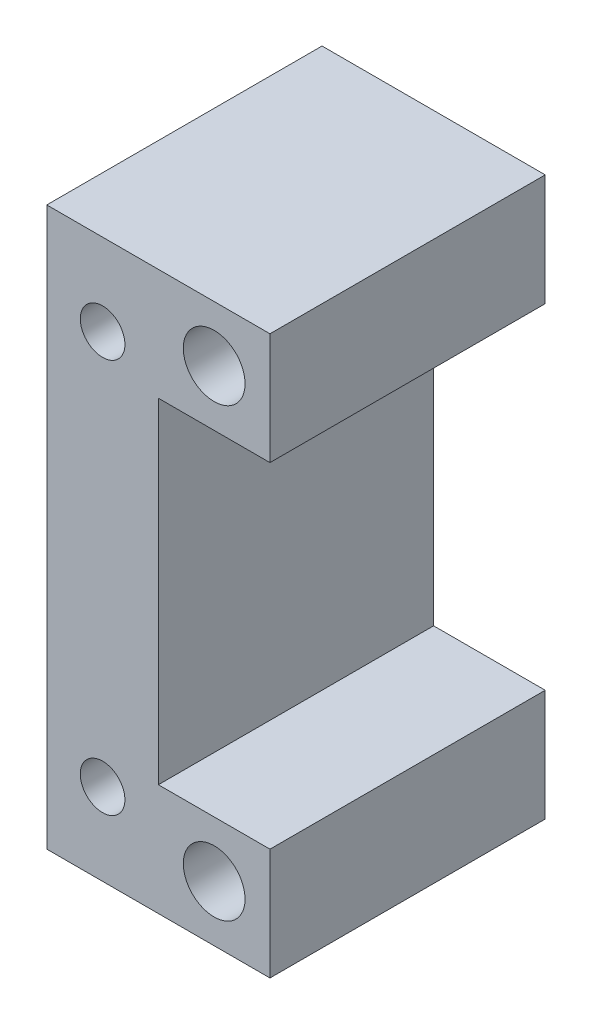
ISO-10303-21;
HEADER;
FILE_DESCRIPTION(('STEP AP214'),'2;1');
FILE_NAME('part.step','',(''),(''),'','','');
FILE_SCHEMA(('AUTOMOTIVE_DESIGN { 1 0 10303 214 1 1 1 1 }'));
ENDSEC;
DATA;
#1=APPLICATION_CONTEXT('core data for automotive mechanical design processes');
#2=APPLICATION_PROTOCOL_DEFINITION('international standard','automotive_design',2000,#1);
#3=PRODUCT_CONTEXT('',#1,'mechanical');
#4=PRODUCT('Part','Part','',(#3));
#5=PRODUCT_RELATED_PRODUCT_CATEGORY('part','',(#4));
#6=PRODUCT_DEFINITION_FORMATION('','',#4);
#7=PRODUCT_DEFINITION_CONTEXT('part definition',#1,'design');
#8=PRODUCT_DEFINITION('design','',#6,#7);
#9=PRODUCT_DEFINITION_SHAPE('','',#8);
#10=(LENGTH_UNIT() NAMED_UNIT(*) SI_UNIT(.MILLI.,.METRE.));
#11=(NAMED_UNIT(*) PLANE_ANGLE_UNIT() SI_UNIT($,.RADIAN.));
#12=(NAMED_UNIT(*) SI_UNIT($,.STERADIAN.) SOLID_ANGLE_UNIT());
#13=UNCERTAINTY_MEASURE_WITH_UNIT(LENGTH_MEASURE(1.E-05),#10,'distance_accuracy_value','');
#14=(GEOMETRIC_REPRESENTATION_CONTEXT(3) GLOBAL_UNCERTAINTY_ASSIGNED_CONTEXT((#13)) GLOBAL_UNIT_ASSIGNED_CONTEXT((#10,
#11,#12)) REPRESENTATION_CONTEXT('',''));
#15=CARTESIAN_POINT('',(0.,0.,0.));
#16=DIRECTION('',(0.,0.,1.));
#17=DIRECTION('',(1.,0.,0.));
#18=AXIS2_PLACEMENT_3D('',#15,#16,#17);
#19=CARTESIAN_POINT('',(7.50000000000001,-11.,0.));
#20=DIRECTION('',(0.,0.,1.));
#21=DIRECTION('',(1.,0.,0.));
#22=AXIS2_PLACEMENT_3D('',#19,#20,#21);
#23=CYLINDRICAL_SURFACE('',#22,3.);
#24=CARTESIAN_POINT('',(7.50000000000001,-11.,37.));
#25=DIRECTION('',(0.,0.,1.));
#26=DIRECTION('',(1.,0.,0.));
#27=AXIS2_PLACEMENT_3D('',#24,#25,#26);
#28=CIRCLE('',#27,3.);
#29=CARTESIAN_POINT('',(10.5,-11.,37.));
#30=VERTEX_POINT('',#29);
#31=EDGE_CURVE('E285',#30,#30,#28,.T.);
#32=ORIENTED_EDGE('',*,*,#31,.T.);
#33=EDGE_LOOP('',(#32));
#34=FACE_BOUND('',#33,.T.);
#35=CARTESIAN_POINT('',(7.50000000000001,-11.,10.));
#36=DIRECTION('',(0.,0.,-1.));
#37=DIRECTION('',(-1.,0.,0.));
#38=AXIS2_PLACEMENT_3D('',#35,#36,#37);
#39=CIRCLE('',#38,3.);
#40=CARTESIAN_POINT('',(4.50000000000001,-11.,10.));
#41=VERTEX_POINT('',#40);
#42=EDGE_CURVE('E38',#41,#41,#39,.F.);
#43=ORIENTED_EDGE('',*,*,#42,.F.);
#44=EDGE_LOOP('',(#43));
#45=FACE_BOUND('',#44,.T.);
#46=ADVANCED_FACE('F34',(#34,#45),#23,.F.);
#47=CARTESIAN_POINT('',(7.50000000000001,-64.,0.));
#48=DIRECTION('',(0.,0.,1.));
#49=DIRECTION('',(1.,0.,0.));
#50=AXIS2_PLACEMENT_3D('',#47,#48,#49);
#51=CYLINDRICAL_SURFACE('',#50,3.);
#52=CARTESIAN_POINT('',(7.50000000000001,-64.,37.));
#53=DIRECTION('',(0.,0.,1.));
#54=DIRECTION('',(1.,0.,0.));
#55=AXIS2_PLACEMENT_3D('',#52,#53,#54);
#56=CIRCLE('',#55,3.);
#57=CARTESIAN_POINT('',(10.5,-64.,37.));
#58=VERTEX_POINT('',#57);
#59=EDGE_CURVE('E282',#58,#58,#56,.T.);
#60=ORIENTED_EDGE('',*,*,#59,.T.);
#61=EDGE_LOOP('',(#60));
#62=FACE_BOUND('',#61,.T.);
#63=CARTESIAN_POINT('',(7.50000000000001,-64.,10.));
#64=DIRECTION('',(0.,0.,-1.));
#65=DIRECTION('',(-1.,0.,0.));
#66=AXIS2_PLACEMENT_3D('',#63,#64,#65);
#67=CIRCLE('',#66,3.);
#68=CARTESIAN_POINT('',(4.5,-64.,10.));
#69=VERTEX_POINT('',#68);
#70=EDGE_CURVE('E222',#69,#69,#67,.F.);
#71=ORIENTED_EDGE('',*,*,#70,.F.);
#72=EDGE_LOOP('',(#71));
#73=FACE_BOUND('',#72,.T.);
#74=ADVANCED_FACE('F355',(#62,#73),#51,.F.);
#75=CARTESIAN_POINT('',(0.,0.,37.));
#76=DIRECTION('',(1.,0.,0.));
#77=DIRECTION('',(0.,1.,0.));
#78=AXIS2_PLACEMENT_3D('',#75,#76,#77);
#79=PLANE('',#78);
#80=DIRECTION('',(0.,-1.,0.));
#81=VECTOR('',#80,1.);
#82=CARTESIAN_POINT('',(0.,0.,0.));
#83=LINE('',#82,#81);
#84=CARTESIAN_POINT('',(0.,0.,0.));
#85=VERTEX_POINT('',#84);
#86=CARTESIAN_POINT('',(0.,-75.,0.));
#87=VERTEX_POINT('',#86);
#88=EDGE_CURVE('E293',#85,#87,#83,.T.);
#89=ORIENTED_EDGE('',*,*,#88,.T.);
#90=DIRECTION('',(0.,0.,-1.));
#91=VECTOR('',#90,1.);
#92=CARTESIAN_POINT('',(0.,-75.,37.));
#93=LINE('',#92,#91);
#94=CARTESIAN_POINT('',(0.,-75.,37.));
#95=VERTEX_POINT('',#94);
#96=EDGE_CURVE('E11',#95,#87,#93,.T.);
#97=ORIENTED_EDGE('',*,*,#96,.F.);
#98=DIRECTION('',(0.,-1.,0.));
#99=VECTOR('',#98,1.);
#100=CARTESIAN_POINT('',(0.,0.,37.));
#101=LINE('',#100,#99);
#102=CARTESIAN_POINT('',(0.,0.,37.));
#103=VERTEX_POINT('',#102);
#104=EDGE_CURVE('E294',#103,#95,#101,.T.);
#105=ORIENTED_EDGE('',*,*,#104,.F.);
#106=DIRECTION('',(0.,0.,-1.));
#107=VECTOR('',#106,1.);
#108=CARTESIAN_POINT('',(0.,0.,37.));
#109=LINE('',#108,#107);
#110=EDGE_CURVE('E312',#103,#85,#109,.T.);
#111=ORIENTED_EDGE('',*,*,#110,.T.);
#112=EDGE_LOOP('',(#89,#97,#105,#111));
#113=FACE_BOUND('',#112,.T.);
#114=ADVANCED_FACE('F36',(#113),#79,.F.);
#115=CARTESIAN_POINT('',(15.,-75.,37.));
#116=DIRECTION('',(0.,1.,0.));
#117=DIRECTION('',(0.,0.,1.));
#118=AXIS2_PLACEMENT_3D('',#115,#116,#117);
#119=PLANE('',#118);
#120=DIRECTION('',(1.,0.,0.));
#121=VECTOR('',#120,1.);
#122=CARTESIAN_POINT('',(15.,-75.,0.));
#123=LINE('',#122,#121);
#124=CARTESIAN_POINT('',(30.,-75.,0.));
#125=VERTEX_POINT('',#124);
#126=EDGE_CURVE('E315',#87,#125,#123,.T.);
#127=ORIENTED_EDGE('',*,*,#126,.T.);
#128=DIRECTION('',(0.,0.,-1.));
#129=VECTOR('',#128,1.);
#130=CARTESIAN_POINT('',(30.,-75.,37.));
#131=LINE('',#130,#129);
#132=CARTESIAN_POINT('',(30.,-75.,37.));
#133=VERTEX_POINT('',#132);
#134=EDGE_CURVE('E43',#133,#125,#131,.T.);
#135=ORIENTED_EDGE('',*,*,#134,.F.);
#136=DIRECTION('',(1.,0.,0.));
#137=VECTOR('',#136,1.);
#138=CARTESIAN_POINT('',(0.,-75.,37.));
#139=LINE('',#138,#137);
#140=EDGE_CURVE('E297',#95,#133,#139,.T.);
#141=ORIENTED_EDGE('',*,*,#140,.F.);
#142=ORIENTED_EDGE('',*,*,#96,.T.);
#143=EDGE_LOOP('',(#127,#135,#141,#142));
#144=FACE_BOUND('',#143,.T.);
#145=ADVANCED_FACE('F397',(#144),#119,.F.);
#146=CARTESIAN_POINT('',(30.,-75.,37.));
#147=DIRECTION('',(-1.,0.,0.));
#148=DIRECTION('',(0.,0.,1.));
#149=AXIS2_PLACEMENT_3D('',#146,#147,#148);
#150=PLANE('',#149);
#151=DIRECTION('',(0.,1.,0.));
#152=VECTOR('',#151,1.);
#153=CARTESIAN_POINT('',(30.,-75.,0.));
#154=LINE('',#153,#152);
#155=CARTESIAN_POINT('',(30.,-60.,0.));
#156=VERTEX_POINT('',#155);
#157=EDGE_CURVE('E317',#125,#156,#154,.T.);
#158=ORIENTED_EDGE('',*,*,#157,.T.);
#159=DIRECTION('',(0.,0.,-1.));
#160=VECTOR('',#159,1.);
#161=CARTESIAN_POINT('',(30.,-60.,37.));
#162=LINE('',#161,#160);
#163=CARTESIAN_POINT('',(30.,-60.,37.));
#164=VERTEX_POINT('',#163);
#165=EDGE_CURVE('E343',#164,#156,#162,.T.);
#166=ORIENTED_EDGE('',*,*,#165,.F.);
#167=DIRECTION('',(0.,1.,0.));
#168=VECTOR('',#167,1.);
#169=CARTESIAN_POINT('',(30.,-75.,37.));
#170=LINE('',#169,#168);
#171=EDGE_CURVE('E300',#133,#164,#170,.T.);
#172=ORIENTED_EDGE('',*,*,#171,.F.);
#173=ORIENTED_EDGE('',*,*,#134,.T.);
#174=EDGE_LOOP('',(#158,#166,#172,#173));
#175=FACE_BOUND('',#174,.T.);
#176=ADVANCED_FACE('F394',(#175),#150,.F.);
#177=CARTESIAN_POINT('',(30.,-60.,37.));
#178=DIRECTION('',(0.,-1.,0.));
#179=DIRECTION('',(1.,0.,0.));
#180=AXIS2_PLACEMENT_3D('',#177,#178,#179);
#181=PLANE('',#180);
#182=DIRECTION('',(-1.,0.,0.));
#183=VECTOR('',#182,1.);
#184=CARTESIAN_POINT('',(30.,-60.,0.));
#185=LINE('',#184,#183);
#186=CARTESIAN_POINT('',(15.,-60.,0.));
#187=VERTEX_POINT('',#186);
#188=EDGE_CURVE('E319',#156,#187,#185,.T.);
#189=ORIENTED_EDGE('',*,*,#188,.T.);
#190=DIRECTION('',(0.,0.,-1.));
#191=VECTOR('',#190,1.);
#192=CARTESIAN_POINT('',(15.,-60.,37.));
#193=LINE('',#192,#191);
#194=CARTESIAN_POINT('',(15.,-60.,37.));
#195=VERTEX_POINT('',#194);
#196=EDGE_CURVE('E340',#195,#187,#193,.T.);
#197=ORIENTED_EDGE('',*,*,#196,.F.);
#198=DIRECTION('',(-1.,0.,0.));
#199=VECTOR('',#198,1.);
#200=CARTESIAN_POINT('',(30.,-60.,37.));
#201=LINE('',#200,#199);
#202=EDGE_CURVE('E302',#164,#195,#201,.T.);
#203=ORIENTED_EDGE('',*,*,#202,.F.);
#204=ORIENTED_EDGE('',*,*,#165,.T.);
#205=EDGE_LOOP('',(#189,#197,#203,#204));
#206=FACE_BOUND('',#205,.T.);
#207=ADVANCED_FACE('F390',(#206),#181,.F.);
#208=CARTESIAN_POINT('',(15.,-15.,37.));
#209=DIRECTION('',(-1.,0.,0.));
#210=DIRECTION('',(0.,-1.,0.));
#211=AXIS2_PLACEMENT_3D('',#208,#209,#210);
#212=PLANE('',#211);
#213=DIRECTION('',(0.,1.,0.));
#214=VECTOR('',#213,1.);
#215=CARTESIAN_POINT('',(15.,-15.,0.));
#216=LINE('',#215,#214);
#217=CARTESIAN_POINT('',(15.,-15.,0.));
#218=VERTEX_POINT('',#217);
#219=EDGE_CURVE('E321',#187,#218,#216,.T.);
#220=ORIENTED_EDGE('',*,*,#219,.T.);
#221=DIRECTION('',(0.,0.,-1.));
#222=VECTOR('',#221,1.);
#223=CARTESIAN_POINT('',(15.,-15.,37.));
#224=LINE('',#223,#222);
#225=CARTESIAN_POINT('',(15.,-15.,37.));
#226=VERTEX_POINT('',#225);
#227=EDGE_CURVE('E337',#226,#218,#224,.T.);
#228=ORIENTED_EDGE('',*,*,#227,.F.);
#229=DIRECTION('',(0.,1.,0.));
#230=VECTOR('',#229,1.);
#231=CARTESIAN_POINT('',(15.,-15.,37.));
#232=LINE('',#231,#230);
#233=EDGE_CURVE('E304',#195,#226,#232,.T.);
#234=ORIENTED_EDGE('',*,*,#233,.F.);
#235=ORIENTED_EDGE('',*,*,#196,.T.);
#236=EDGE_LOOP('',(#220,#228,#234,#235));
#237=FACE_BOUND('',#236,.T.);
#238=ADVANCED_FACE('F386',(#237),#212,.F.);
#239=CARTESIAN_POINT('',(15.,-15.,37.));
#240=DIRECTION('',(0.,1.,0.));
#241=DIRECTION('',(-1.,0.,0.));
#242=AXIS2_PLACEMENT_3D('',#239,#240,#241);
#243=PLANE('',#242);
#244=DIRECTION('',(1.,0.,0.));
#245=VECTOR('',#244,1.);
#246=CARTESIAN_POINT('',(15.,-15.,0.));
#247=LINE('',#246,#245);
#248=CARTESIAN_POINT('',(30.,-15.,0.));
#249=VERTEX_POINT('',#248);
#250=EDGE_CURVE('E323',#218,#249,#247,.T.);
#251=ORIENTED_EDGE('',*,*,#250,.T.);
#252=DIRECTION('',(0.,0.,-1.));
#253=VECTOR('',#252,1.);
#254=CARTESIAN_POINT('',(30.,-15.,37.));
#255=LINE('',#254,#253);
#256=CARTESIAN_POINT('',(30.,-15.,37.));
#257=VERTEX_POINT('',#256);
#258=EDGE_CURVE('E334',#257,#249,#255,.T.);
#259=ORIENTED_EDGE('',*,*,#258,.F.);
#260=DIRECTION('',(1.,0.,0.));
#261=VECTOR('',#260,1.);
#262=CARTESIAN_POINT('',(15.,-15.,37.));
#263=LINE('',#262,#261);
#264=EDGE_CURVE('E306',#226,#257,#263,.T.);
#265=ORIENTED_EDGE('',*,*,#264,.F.);
#266=ORIENTED_EDGE('',*,*,#227,.T.);
#267=EDGE_LOOP('',(#251,#259,#265,#266));
#268=FACE_BOUND('',#267,.T.);
#269=ADVANCED_FACE('F382',(#268),#243,.F.);
#270=CARTESIAN_POINT('',(30.,-15.,37.));
#271=DIRECTION('',(-1.,0.,0.));
#272=DIRECTION('',(0.,-1.,0.));
#273=AXIS2_PLACEMENT_3D('',#270,#271,#272);
#274=PLANE('',#273);
#275=DIRECTION('',(0.,1.,0.));
#276=VECTOR('',#275,1.);
#277=CARTESIAN_POINT('',(30.,-15.,0.));
#278=LINE('',#277,#276);
#279=CARTESIAN_POINT('',(30.,0.,0.));
#280=VERTEX_POINT('',#279);
#281=EDGE_CURVE('E325',#249,#280,#278,.T.);
#282=ORIENTED_EDGE('',*,*,#281,.T.);
#283=DIRECTION('',(0.,0.,-1.));
#284=VECTOR('',#283,1.);
#285=CARTESIAN_POINT('',(30.,0.,37.));
#286=LINE('',#285,#284);
#287=CARTESIAN_POINT('',(30.,0.,37.));
#288=VERTEX_POINT('',#287);
#289=EDGE_CURVE('E331',#288,#280,#286,.T.);
#290=ORIENTED_EDGE('',*,*,#289,.F.);
#291=DIRECTION('',(0.,1.,0.));
#292=VECTOR('',#291,1.);
#293=CARTESIAN_POINT('',(30.,-15.,37.));
#294=LINE('',#293,#292);
#295=EDGE_CURVE('E308',#257,#288,#294,.T.);
#296=ORIENTED_EDGE('',*,*,#295,.F.);
#297=ORIENTED_EDGE('',*,*,#258,.T.);
#298=EDGE_LOOP('',(#282,#290,#296,#297));
#299=FACE_BOUND('',#298,.T.);
#300=ADVANCED_FACE('F378',(#299),#274,.F.);
#301=CARTESIAN_POINT('',(0.,0.,37.));
#302=DIRECTION('',(0.,-1.,0.));
#303=DIRECTION('',(1.,0.,0.));
#304=AXIS2_PLACEMENT_3D('',#301,#302,#303);
#305=PLANE('',#304);
#306=DIRECTION('',(-1.,0.,0.));
#307=VECTOR('',#306,1.);
#308=CARTESIAN_POINT('',(0.,0.,0.));
#309=LINE('',#308,#307);
#310=EDGE_CURVE('E298',#280,#85,#309,.T.);
#311=ORIENTED_EDGE('',*,*,#310,.T.);
#312=ORIENTED_EDGE('',*,*,#110,.F.);
#313=DIRECTION('',(-1.,0.,0.));
#314=VECTOR('',#313,1.);
#315=CARTESIAN_POINT('',(30.,0.,37.));
#316=LINE('',#315,#314);
#317=EDGE_CURVE('E310',#288,#103,#316,.T.);
#318=ORIENTED_EDGE('',*,*,#317,.F.);
#319=ORIENTED_EDGE('',*,*,#289,.T.);
#320=EDGE_LOOP('',(#311,#312,#318,#319));
#321=FACE_BOUND('',#320,.T.);
#322=ADVANCED_FACE('F370',(#321),#305,.F.);
#323=CARTESIAN_POINT('',(0.,0.,37.));
#324=DIRECTION('',(0.,0.,1.));
#325=DIRECTION('',(1.,0.,0.));
#326=AXIS2_PLACEMENT_3D('',#323,#324,#325);
#327=PLANE('',#326);
#328=ORIENTED_EDGE('',*,*,#59,.F.);
#329=EDGE_LOOP('',(#328));
#330=FACE_BOUND('',#329,.T.);
#331=CARTESIAN_POINT('',(22.5,-7.5,37.));
#332=DIRECTION('',(0.,0.,1.));
#333=DIRECTION('',(1.,0.,0.));
#334=AXIS2_PLACEMENT_3D('',#331,#332,#333);
#335=CIRCLE('',#334,4.15);
#336=CARTESIAN_POINT('',(26.65,-7.5,37.));
#337=VERTEX_POINT('',#336);
#338=EDGE_CURVE('E278',#337,#337,#335,.T.);
#339=ORIENTED_EDGE('',*,*,#338,.F.);
#340=EDGE_LOOP('',(#339));
#341=FACE_BOUND('',#340,.T.);
#342=CARTESIAN_POINT('',(22.5,-67.5,37.));
#343=DIRECTION('',(0.,0.,1.));
#344=DIRECTION('',(1.,0.,0.));
#345=AXIS2_PLACEMENT_3D('',#342,#343,#344);
#346=CIRCLE('',#345,4.15);
#347=CARTESIAN_POINT('',(26.65,-67.5,37.));
#348=VERTEX_POINT('',#347);
#349=EDGE_CURVE('E279',#348,#348,#346,.T.);
#350=ORIENTED_EDGE('',*,*,#349,.F.);
#351=EDGE_LOOP('',(#350));
#352=FACE_BOUND('',#351,.T.);
#353=ORIENTED_EDGE('',*,*,#31,.F.);
#354=EDGE_LOOP('',(#353));
#355=FACE_BOUND('',#354,.T.);
#356=ORIENTED_EDGE('',*,*,#104,.T.);
#357=ORIENTED_EDGE('',*,*,#140,.T.);
#358=ORIENTED_EDGE('',*,*,#171,.T.);
#359=ORIENTED_EDGE('',*,*,#202,.T.);
#360=ORIENTED_EDGE('',*,*,#233,.T.);
#361=ORIENTED_EDGE('',*,*,#264,.T.);
#362=ORIENTED_EDGE('',*,*,#295,.T.);
#363=ORIENTED_EDGE('',*,*,#317,.T.);
#364=EDGE_LOOP('',(#356,#357,#358,#359,#360,#361,#362,#363));
#365=FACE_BOUND('',#364,.T.);
#366=ADVANCED_FACE('F366',(#330,#341,#352,#355,#365),#327,.T.);
#367=CARTESIAN_POINT('',(0.,0.,0.));
#368=DIRECTION('',(0.,0.,1.));
#369=DIRECTION('',(1.,0.,0.));
#370=AXIS2_PLACEMENT_3D('',#367,#368,#369);
#371=PLANE('',#370);
#372=DIRECTION('',(0.866025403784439,-0.499999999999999,0.));
#373=VECTOR('',#372,1.);
#374=CARTESIAN_POINT('',(7.5,-58.2264973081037,0.));
#375=LINE('',#374,#373);
#376=CARTESIAN_POINT('',(7.5,-58.2264973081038,0.));
#377=VERTEX_POINT('',#376);
#378=CARTESIAN_POINT('',(12.5,-61.1132486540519,0.));
#379=VERTEX_POINT('',#378);
#380=EDGE_CURVE('E209',#377,#379,#375,.T.);
#381=ORIENTED_EDGE('',*,*,#380,.F.);
#382=DIRECTION('',(0.866025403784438,0.5,0.));
#383=VECTOR('',#382,1.);
#384=CARTESIAN_POINT('',(2.50000000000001,-61.1132486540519,0.));
#385=LINE('',#384,#383);
#386=CARTESIAN_POINT('',(2.50000000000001,-61.1132486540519,0.));
#387=VERTEX_POINT('',#386);
#388=EDGE_CURVE('E51',#387,#377,#385,.T.);
#389=ORIENTED_EDGE('',*,*,#388,.F.);
#390=DIRECTION('',(0.,1.,0.));
#391=VECTOR('',#390,1.);
#392=CARTESIAN_POINT('',(2.50000000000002,-66.8867513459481,0.));
#393=LINE('',#392,#391);
#394=CARTESIAN_POINT('',(2.50000000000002,-66.8867513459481,0.));
#395=VERTEX_POINT('',#394);
#396=EDGE_CURVE('E195',#395,#387,#393,.T.);
#397=ORIENTED_EDGE('',*,*,#396,.F.);
#398=DIRECTION('',(-0.866025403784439,0.499999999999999,0.));
#399=VECTOR('',#398,1.);
#400=CARTESIAN_POINT('',(7.50000000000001,-69.7735026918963,0.));
#401=LINE('',#400,#399);
#402=CARTESIAN_POINT('',(7.50000000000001,-69.7735026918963,0.));
#403=VERTEX_POINT('',#402);
#404=EDGE_CURVE('E198',#403,#395,#401,.T.);
#405=ORIENTED_EDGE('',*,*,#404,.F.);
#406=DIRECTION('',(-0.866025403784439,-0.5,0.));
#407=VECTOR('',#406,1.);
#408=CARTESIAN_POINT('',(12.5,-66.8867513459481,0.));
#409=LINE('',#408,#407);
#410=CARTESIAN_POINT('',(12.5,-66.8867513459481,0.));
#411=VERTEX_POINT('',#410);
#412=EDGE_CURVE('E215',#411,#403,#409,.T.);
#413=ORIENTED_EDGE('',*,*,#412,.F.);
#414=DIRECTION('',(0.,-1.,0.));
#415=VECTOR('',#414,1.);
#416=CARTESIAN_POINT('',(12.5,-61.1132486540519,0.));
#417=LINE('',#416,#415);
#418=EDGE_CURVE('E212',#379,#411,#417,.T.);
#419=ORIENTED_EDGE('',*,*,#418,.F.);
#420=EDGE_LOOP('',(#381,#389,#397,#405,#413,#419));
#421=FACE_BOUND('',#420,.T.);
#422=DIRECTION('',(0.866025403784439,-0.5,0.));
#423=VECTOR('',#422,1.);
#424=CARTESIAN_POINT('',(7.50000000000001,-5.22649730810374,0.));
#425=LINE('',#424,#423);
#426=CARTESIAN_POINT('',(7.50000000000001,-5.22649730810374,0.));
#427=VERTEX_POINT('',#426);
#428=CARTESIAN_POINT('',(12.5,-8.11324865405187,0.));
#429=VERTEX_POINT('',#428);
#430=EDGE_CURVE('E251',#427,#429,#425,.T.);
#431=ORIENTED_EDGE('',*,*,#430,.F.);
#432=DIRECTION('',(0.866025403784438,0.5,0.));
#433=VECTOR('',#432,1.);
#434=CARTESIAN_POINT('',(2.50000000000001,-8.11324865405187,0.));
#435=LINE('',#434,#433);
#436=CARTESIAN_POINT('',(2.50000000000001,-8.11324865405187,0.));
#437=VERTEX_POINT('',#436);
#438=EDGE_CURVE('E59',#437,#427,#435,.T.);
#439=ORIENTED_EDGE('',*,*,#438,.F.);
#440=DIRECTION('',(0.,1.,0.));
#441=VECTOR('',#440,1.);
#442=CARTESIAN_POINT('',(2.50000000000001,-13.8867513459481,0.));
#443=LINE('',#442,#441);
#444=CARTESIAN_POINT('',(2.50000000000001,-13.8867513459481,0.));
#445=VERTEX_POINT('',#444);
#446=EDGE_CURVE('E234',#445,#437,#443,.T.);
#447=ORIENTED_EDGE('',*,*,#446,.F.);
#448=DIRECTION('',(-0.866025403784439,0.5,0.));
#449=VECTOR('',#448,1.);
#450=CARTESIAN_POINT('',(7.50000000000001,-16.7735026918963,0.));
#451=LINE('',#450,#449);
#452=CARTESIAN_POINT('',(7.50000000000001,-16.7735026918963,0.));
#453=VERTEX_POINT('',#452);
#454=EDGE_CURVE('E260',#453,#445,#451,.T.);
#455=ORIENTED_EDGE('',*,*,#454,.F.);
#456=DIRECTION('',(-0.866025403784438,-0.5,0.));
#457=VECTOR('',#456,1.);
#458=CARTESIAN_POINT('',(12.5,-13.8867513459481,0.));
#459=LINE('',#458,#457);
#460=CARTESIAN_POINT('',(12.5,-13.8867513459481,0.));
#461=VERTEX_POINT('',#460);
#462=EDGE_CURVE('E257',#461,#453,#459,.T.);
#463=ORIENTED_EDGE('',*,*,#462,.F.);
#464=DIRECTION('',(0.,-1.,0.));
#465=VECTOR('',#464,1.);
#466=CARTESIAN_POINT('',(12.5,-8.11324865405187,0.));
#467=LINE('',#466,#465);
#468=EDGE_CURVE('E254',#429,#461,#467,.T.);
#469=ORIENTED_EDGE('',*,*,#468,.F.);
#470=EDGE_LOOP('',(#431,#439,#447,#455,#463,#469));
#471=FACE_BOUND('',#470,.T.);
#472=CARTESIAN_POINT('',(22.5,-7.5,0.));
#473=DIRECTION('',(0.,0.,1.));
#474=DIRECTION('',(1.,0.,0.));
#475=AXIS2_PLACEMENT_3D('',#472,#473,#474);
#476=CIRCLE('',#475,4.15);
#477=CARTESIAN_POINT('',(26.65,-7.5,0.));
#478=VERTEX_POINT('',#477);
#479=EDGE_CURVE('E286',#478,#478,#476,.T.);
#480=ORIENTED_EDGE('',*,*,#479,.T.);
#481=EDGE_LOOP('',(#480));
#482=FACE_BOUND('',#481,.T.);
#483=CARTESIAN_POINT('',(22.5,-67.5,0.));
#484=DIRECTION('',(0.,0.,1.));
#485=DIRECTION('',(1.,0.,0.));
#486=AXIS2_PLACEMENT_3D('',#483,#484,#485);
#487=CIRCLE('',#486,4.15);
#488=CARTESIAN_POINT('',(26.65,-67.5,0.));
#489=VERTEX_POINT('',#488);
#490=EDGE_CURVE('E275',#489,#489,#487,.T.);
#491=ORIENTED_EDGE('',*,*,#490,.T.);
#492=EDGE_LOOP('',(#491));
#493=FACE_BOUND('',#492,.T.);
#494=ORIENTED_EDGE('',*,*,#88,.F.);
#495=ORIENTED_EDGE('',*,*,#310,.F.);
#496=ORIENTED_EDGE('',*,*,#281,.F.);
#497=ORIENTED_EDGE('',*,*,#250,.F.);
#498=ORIENTED_EDGE('',*,*,#219,.F.);
#499=ORIENTED_EDGE('',*,*,#188,.F.);
#500=ORIENTED_EDGE('',*,*,#157,.F.);
#501=ORIENTED_EDGE('',*,*,#126,.F.);
#502=EDGE_LOOP('',(#494,#495,#496,#497,#498,#499,#500,#501));
#503=FACE_BOUND('',#502,.T.);
#504=ADVANCED_FACE('F369',(#421,#471,#482,#493,#503),#371,.F.);
#505=CARTESIAN_POINT('',(22.5,-67.5,0.));
#506=DIRECTION('',(0.,0.,1.));
#507=DIRECTION('',(1.,0.,0.));
#508=AXIS2_PLACEMENT_3D('',#505,#506,#507);
#509=CYLINDRICAL_SURFACE('',#508,4.15);
#510=ORIENTED_EDGE('',*,*,#490,.F.);
#511=EDGE_LOOP('',(#510));
#512=FACE_BOUND('',#511,.T.);
#513=ORIENTED_EDGE('',*,*,#349,.T.);
#514=EDGE_LOOP('',(#513));
#515=FACE_BOUND('',#514,.T.);
#516=ADVANCED_FACE('F374',(#512,#515),#509,.F.);
#517=CARTESIAN_POINT('',(22.5,-7.5,0.));
#518=DIRECTION('',(0.,0.,1.));
#519=DIRECTION('',(1.,0.,0.));
#520=AXIS2_PLACEMENT_3D('',#517,#518,#519);
#521=CYLINDRICAL_SURFACE('',#520,4.15);
#522=ORIENTED_EDGE('',*,*,#479,.F.);
#523=EDGE_LOOP('',(#522));
#524=FACE_BOUND('',#523,.T.);
#525=ORIENTED_EDGE('',*,*,#338,.T.);
#526=EDGE_LOOP('',(#525));
#527=FACE_BOUND('',#526,.T.);
#528=ADVANCED_FACE('F365',(#524,#527),#521,.F.);
#529=CARTESIAN_POINT('',(0.,0.,10.));
#530=DIRECTION('',(0.,0.,-1.));
#531=DIRECTION('',(-1.,0.,0.));
#532=AXIS2_PLACEMENT_3D('',#529,#530,#531);
#533=PLANE('',#532);
#534=DIRECTION('',(0.866025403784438,0.5,0.));
#535=VECTOR('',#534,1.);
#536=CARTESIAN_POINT('',(2.50000000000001,-61.1132486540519,10.));
#537=LINE('',#536,#535);
#538=CARTESIAN_POINT('',(2.50000000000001,-61.1132486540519,10.));
#539=VERTEX_POINT('',#538);
#540=CARTESIAN_POINT('',(7.5,-58.2264973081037,10.));
#541=VERTEX_POINT('',#540);
#542=EDGE_CURVE('E175',#539,#541,#537,.T.);
#543=ORIENTED_EDGE('',*,*,#542,.T.);
#544=DIRECTION('',(0.866025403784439,-0.499999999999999,0.));
#545=VECTOR('',#544,1.);
#546=CARTESIAN_POINT('',(7.5,-58.2264973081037,10.));
#547=LINE('',#546,#545);
#548=CARTESIAN_POINT('',(12.5,-61.1132486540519,10.));
#549=VERTEX_POINT('',#548);
#550=EDGE_CURVE('E184',#541,#549,#547,.T.);
#551=ORIENTED_EDGE('',*,*,#550,.T.);
#552=DIRECTION('',(0.,-1.,0.));
#553=VECTOR('',#552,1.);
#554=CARTESIAN_POINT('',(12.5,-61.1132486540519,10.));
#555=LINE('',#554,#553);
#556=CARTESIAN_POINT('',(12.5,-66.8867513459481,10.));
#557=VERTEX_POINT('',#556);
#558=EDGE_CURVE('E189',#549,#557,#555,.T.);
#559=ORIENTED_EDGE('',*,*,#558,.T.);
#560=DIRECTION('',(-0.866025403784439,-0.5,0.));
#561=VECTOR('',#560,1.);
#562=CARTESIAN_POINT('',(12.5,-66.8867513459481,10.));
#563=LINE('',#562,#561);
#564=CARTESIAN_POINT('',(7.50000000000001,-69.7735026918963,10.));
#565=VERTEX_POINT('',#564);
#566=EDGE_CURVE('E202',#557,#565,#563,.T.);
#567=ORIENTED_EDGE('',*,*,#566,.T.);
#568=DIRECTION('',(-0.866025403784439,0.499999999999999,0.));
#569=VECTOR('',#568,1.);
#570=CARTESIAN_POINT('',(7.50000000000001,-69.7735026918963,10.));
#571=LINE('',#570,#569);
#572=CARTESIAN_POINT('',(2.50000000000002,-66.8867513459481,10.));
#573=VERTEX_POINT('',#572);
#574=EDGE_CURVE('E205',#565,#573,#571,.T.);
#575=ORIENTED_EDGE('',*,*,#574,.T.);
#576=DIRECTION('',(0.,1.,0.));
#577=VECTOR('',#576,1.);
#578=CARTESIAN_POINT('',(2.50000000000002,-66.8867513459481,10.));
#579=LINE('',#578,#577);
#580=EDGE_CURVE('E181',#573,#539,#579,.T.);
#581=ORIENTED_EDGE('',*,*,#580,.T.);
#582=EDGE_LOOP('',(#543,#551,#559,#567,#575,#581));
#583=FACE_BOUND('',#582,.T.);
#584=ORIENTED_EDGE('',*,*,#70,.T.);
#585=EDGE_LOOP('',(#584));
#586=FACE_BOUND('',#585,.T.);
#587=ADVANCED_FACE('F191',(#583,#586),#533,.T.);
#588=CARTESIAN_POINT('',(2.50000000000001,-61.1132486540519,10.));
#589=DIRECTION('',(-0.5,0.866025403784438,0.));
#590=DIRECTION('',(-0.866025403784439,-0.5,0.));
#591=AXIS2_PLACEMENT_3D('',#588,#589,#590);
#592=PLANE('',#591);
#593=ORIENTED_EDGE('',*,*,#388,.T.);
#594=DIRECTION('',(0.,0.,-1.));
#595=VECTOR('',#594,1.);
#596=CARTESIAN_POINT('',(7.5,-58.2264973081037,10.));
#597=LINE('',#596,#595);
#598=EDGE_CURVE('E171',#541,#377,#597,.T.);
#599=ORIENTED_EDGE('',*,*,#598,.F.);
#600=ORIENTED_EDGE('',*,*,#542,.F.);
#601=DIRECTION('',(0.,0.,-1.));
#602=VECTOR('',#601,1.);
#603=CARTESIAN_POINT('',(2.50000000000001,-61.1132486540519,10.));
#604=LINE('',#603,#602);
#605=EDGE_CURVE('E220',#539,#387,#604,.T.);
#606=ORIENTED_EDGE('',*,*,#605,.T.);
#607=EDGE_LOOP('',(#593,#599,#600,#606));
#608=FACE_BOUND('',#607,.T.);
#609=ADVANCED_FACE('F173',(#608),#592,.F.);
#610=CARTESIAN_POINT('',(2.50000000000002,-66.8867513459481,10.));
#611=DIRECTION('',(-1.,0.,0.));
#612=DIRECTION('',(0.,-1.,0.));
#613=AXIS2_PLACEMENT_3D('',#610,#611,#612);
#614=PLANE('',#613);
#615=ORIENTED_EDGE('',*,*,#396,.T.);
#616=ORIENTED_EDGE('',*,*,#605,.F.);
#617=ORIENTED_EDGE('',*,*,#580,.F.);
#618=DIRECTION('',(0.,0.,-1.));
#619=VECTOR('',#618,1.);
#620=CARTESIAN_POINT('',(2.50000000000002,-66.8867513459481,10.));
#621=LINE('',#620,#619);
#622=EDGE_CURVE('E223',#573,#395,#621,.T.);
#623=ORIENTED_EDGE('',*,*,#622,.T.);
#624=EDGE_LOOP('',(#615,#616,#617,#623));
#625=FACE_BOUND('',#624,.T.);
#626=ADVANCED_FACE('F465',(#625),#614,.F.);
#627=CARTESIAN_POINT('',(7.50000000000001,-69.7735026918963,10.));
#628=DIRECTION('',(-0.5,-0.866025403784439,0.));
#629=DIRECTION('',(0.866025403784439,-0.5,0.));
#630=AXIS2_PLACEMENT_3D('',#627,#628,#629);
#631=PLANE('',#630);
#632=ORIENTED_EDGE('',*,*,#404,.T.);
#633=ORIENTED_EDGE('',*,*,#622,.F.);
#634=ORIENTED_EDGE('',*,*,#574,.F.);
#635=DIRECTION('',(0.,0.,-1.));
#636=VECTOR('',#635,1.);
#637=CARTESIAN_POINT('',(7.50000000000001,-69.7735026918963,10.));
#638=LINE('',#637,#636);
#639=EDGE_CURVE('E225',#565,#403,#638,.T.);
#640=ORIENTED_EDGE('',*,*,#639,.T.);
#641=EDGE_LOOP('',(#632,#633,#634,#640));
#642=FACE_BOUND('',#641,.T.);
#643=ADVANCED_FACE('F474',(#642),#631,.F.);
#644=CARTESIAN_POINT('',(12.5,-66.8867513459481,10.));
#645=DIRECTION('',(0.5,-0.866025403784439,0.));
#646=DIRECTION('',(0.866025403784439,0.5,0.));
#647=AXIS2_PLACEMENT_3D('',#644,#645,#646);
#648=PLANE('',#647);
#649=ORIENTED_EDGE('',*,*,#412,.T.);
#650=ORIENTED_EDGE('',*,*,#639,.F.);
#651=ORIENTED_EDGE('',*,*,#566,.F.);
#652=DIRECTION('',(0.,0.,-1.));
#653=VECTOR('',#652,1.);
#654=CARTESIAN_POINT('',(12.5,-66.8867513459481,10.));
#655=LINE('',#654,#653);
#656=EDGE_CURVE('E227',#557,#411,#655,.T.);
#657=ORIENTED_EDGE('',*,*,#656,.T.);
#658=EDGE_LOOP('',(#649,#650,#651,#657));
#659=FACE_BOUND('',#658,.T.);
#660=ADVANCED_FACE('F484',(#659),#648,.F.);
#661=CARTESIAN_POINT('',(12.5,-61.1132486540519,10.));
#662=DIRECTION('',(1.,0.,0.));
#663=DIRECTION('',(0.,0.,-1.));
#664=AXIS2_PLACEMENT_3D('',#661,#662,#663);
#665=PLANE('',#664);
#666=ORIENTED_EDGE('',*,*,#418,.T.);
#667=ORIENTED_EDGE('',*,*,#656,.F.);
#668=ORIENTED_EDGE('',*,*,#558,.F.);
#669=DIRECTION('',(0.,0.,-1.));
#670=VECTOR('',#669,1.);
#671=CARTESIAN_POINT('',(12.5,-61.1132486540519,10.));
#672=LINE('',#671,#670);
#673=EDGE_CURVE('E180',#549,#379,#672,.T.);
#674=ORIENTED_EDGE('',*,*,#673,.T.);
#675=EDGE_LOOP('',(#666,#667,#668,#674));
#676=FACE_BOUND('',#675,.T.);
#677=ADVANCED_FACE('F494',(#676),#665,.F.);
#678=CARTESIAN_POINT('',(7.5,-58.2264973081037,10.));
#679=DIRECTION('',(0.499999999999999,0.866025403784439,0.));
#680=DIRECTION('',(-0.866025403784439,0.499999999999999,0.));
#681=AXIS2_PLACEMENT_3D('',#678,#679,#680);
#682=PLANE('',#681);
#683=ORIENTED_EDGE('',*,*,#380,.T.);
#684=ORIENTED_EDGE('',*,*,#673,.F.);
#685=ORIENTED_EDGE('',*,*,#550,.F.);
#686=ORIENTED_EDGE('',*,*,#598,.T.);
#687=EDGE_LOOP('',(#683,#684,#685,#686));
#688=FACE_BOUND('',#687,.T.);
#689=ADVANCED_FACE('F185',(#688),#682,.F.);
#690=CARTESIAN_POINT('',(0.,0.,10.));
#691=DIRECTION('',(0.,0.,-1.));
#692=DIRECTION('',(-1.,0.,0.));
#693=AXIS2_PLACEMENT_3D('',#690,#691,#692);
#694=PLANE('',#693);
#695=DIRECTION('',(0.866025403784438,0.5,0.));
#696=VECTOR('',#695,1.);
#697=CARTESIAN_POINT('',(2.50000000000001,-8.11324865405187,10.));
#698=LINE('',#697,#696);
#699=CARTESIAN_POINT('',(2.50000000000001,-8.11324865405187,10.));
#700=VERTEX_POINT('',#699);
#701=CARTESIAN_POINT('',(7.50000000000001,-5.22649730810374,10.));
#702=VERTEX_POINT('',#701);
#703=EDGE_CURVE('E230',#700,#702,#698,.T.);
#704=ORIENTED_EDGE('',*,*,#703,.T.);
#705=DIRECTION('',(0.866025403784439,-0.5,0.));
#706=VECTOR('',#705,1.);
#707=CARTESIAN_POINT('',(7.50000000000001,-5.22649730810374,10.));
#708=LINE('',#707,#706);
#709=CARTESIAN_POINT('',(12.5,-8.11324865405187,10.));
#710=VERTEX_POINT('',#709);
#711=EDGE_CURVE('E233',#702,#710,#708,.T.);
#712=ORIENTED_EDGE('',*,*,#711,.T.);
#713=DIRECTION('',(0.,-1.,0.));
#714=VECTOR('',#713,1.);
#715=CARTESIAN_POINT('',(12.5,-8.11324865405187,10.));
#716=LINE('',#715,#714);
#717=CARTESIAN_POINT('',(12.5,-13.8867513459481,10.));
#718=VERTEX_POINT('',#717);
#719=EDGE_CURVE('E237',#710,#718,#716,.T.);
#720=ORIENTED_EDGE('',*,*,#719,.T.);
#721=DIRECTION('',(-0.866025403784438,-0.5,0.));
#722=VECTOR('',#721,1.);
#723=CARTESIAN_POINT('',(12.5,-13.8867513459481,10.));
#724=LINE('',#723,#722);
#725=CARTESIAN_POINT('',(7.50000000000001,-16.7735026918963,10.));
#726=VERTEX_POINT('',#725);
#727=EDGE_CURVE('E240',#718,#726,#724,.T.);
#728=ORIENTED_EDGE('',*,*,#727,.T.);
#729=DIRECTION('',(-0.866025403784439,0.5,0.));
#730=VECTOR('',#729,1.);
#731=CARTESIAN_POINT('',(7.50000000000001,-16.7735026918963,10.));
#732=LINE('',#731,#730);
#733=CARTESIAN_POINT('',(2.50000000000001,-13.8867513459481,10.));
#734=VERTEX_POINT('',#733);
#735=EDGE_CURVE('E243',#726,#734,#732,.T.);
#736=ORIENTED_EDGE('',*,*,#735,.T.);
#737=DIRECTION('',(0.,1.,0.));
#738=VECTOR('',#737,1.);
#739=CARTESIAN_POINT('',(2.50000000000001,-13.8867513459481,10.));
#740=LINE('',#739,#738);
#741=EDGE_CURVE('E246',#734,#700,#740,.T.);
#742=ORIENTED_EDGE('',*,*,#741,.T.);
#743=EDGE_LOOP('',(#704,#712,#720,#728,#736,#742));
#744=FACE_BOUND('',#743,.T.);
#745=ORIENTED_EDGE('',*,*,#42,.T.);
#746=EDGE_LOOP('',(#745));
#747=FACE_BOUND('',#746,.T.);
#748=ADVANCED_FACE('F352',(#744,#747),#694,.T.);
#749=CARTESIAN_POINT('',(2.50000000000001,-8.11324865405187,10.));
#750=DIRECTION('',(-0.5,0.866025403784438,0.));
#751=DIRECTION('',(-0.866025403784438,-0.5,0.));
#752=AXIS2_PLACEMENT_3D('',#749,#750,#751);
#753=PLANE('',#752);
#754=ORIENTED_EDGE('',*,*,#438,.T.);
#755=DIRECTION('',(0.,0.,-1.));
#756=VECTOR('',#755,1.);
#757=CARTESIAN_POINT('',(7.50000000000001,-5.22649730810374,10.));
#758=LINE('',#757,#756);
#759=EDGE_CURVE('E249',#702,#427,#758,.T.);
#760=ORIENTED_EDGE('',*,*,#759,.F.);
#761=ORIENTED_EDGE('',*,*,#703,.F.);
#762=DIRECTION('',(0.,0.,-1.));
#763=VECTOR('',#762,1.);
#764=CARTESIAN_POINT('',(2.50000000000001,-8.11324865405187,10.));
#765=LINE('',#764,#763);
#766=EDGE_CURVE('E210',#700,#437,#765,.T.);
#767=ORIENTED_EDGE('',*,*,#766,.T.);
#768=EDGE_LOOP('',(#754,#760,#761,#767));
#769=FACE_BOUND('',#768,.T.);
#770=ADVANCED_FACE('F521',(#769),#753,.F.);
#771=CARTESIAN_POINT('',(2.50000000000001,-13.8867513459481,10.));
#772=DIRECTION('',(-1.,0.,0.));
#773=DIRECTION('',(0.,-1.,0.));
#774=AXIS2_PLACEMENT_3D('',#771,#772,#773);
#775=PLANE('',#774);
#776=ORIENTED_EDGE('',*,*,#446,.T.);
#777=ORIENTED_EDGE('',*,*,#766,.F.);
#778=ORIENTED_EDGE('',*,*,#741,.F.);
#779=DIRECTION('',(0.,0.,-1.));
#780=VECTOR('',#779,1.);
#781=CARTESIAN_POINT('',(2.50000000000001,-13.8867513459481,10.));
#782=LINE('',#781,#780);
#783=EDGE_CURVE('E266',#734,#445,#782,.T.);
#784=ORIENTED_EDGE('',*,*,#783,.T.);
#785=EDGE_LOOP('',(#776,#777,#778,#784));
#786=FACE_BOUND('',#785,.T.);
#787=ADVANCED_FACE('F531',(#786),#775,.F.);
#788=CARTESIAN_POINT('',(7.50000000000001,-16.7735026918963,10.));
#789=DIRECTION('',(-0.5,-0.866025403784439,0.));
#790=DIRECTION('',(0.866025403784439,-0.5,0.));
#791=AXIS2_PLACEMENT_3D('',#788,#789,#790);
#792=PLANE('',#791);
#793=ORIENTED_EDGE('',*,*,#454,.T.);
#794=ORIENTED_EDGE('',*,*,#783,.F.);
#795=ORIENTED_EDGE('',*,*,#735,.F.);
#796=DIRECTION('',(0.,0.,-1.));
#797=VECTOR('',#796,1.);
#798=CARTESIAN_POINT('',(7.50000000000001,-16.7735026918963,10.));
#799=LINE('',#798,#797);
#800=EDGE_CURVE('E268',#726,#453,#799,.T.);
#801=ORIENTED_EDGE('',*,*,#800,.T.);
#802=EDGE_LOOP('',(#793,#794,#795,#801));
#803=FACE_BOUND('',#802,.T.);
#804=ADVANCED_FACE('F540',(#803),#792,.F.);
#805=CARTESIAN_POINT('',(12.5,-13.8867513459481,10.));
#806=DIRECTION('',(0.5,-0.866025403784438,0.));
#807=DIRECTION('',(0.866025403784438,0.5,0.));
#808=AXIS2_PLACEMENT_3D('',#805,#806,#807);
#809=PLANE('',#808);
#810=ORIENTED_EDGE('',*,*,#462,.T.);
#811=ORIENTED_EDGE('',*,*,#800,.F.);
#812=ORIENTED_EDGE('',*,*,#727,.F.);
#813=DIRECTION('',(0.,0.,-1.));
#814=VECTOR('',#813,1.);
#815=CARTESIAN_POINT('',(12.5,-13.8867513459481,10.));
#816=LINE('',#815,#814);
#817=EDGE_CURVE('E270',#718,#461,#816,.T.);
#818=ORIENTED_EDGE('',*,*,#817,.T.);
#819=EDGE_LOOP('',(#810,#811,#812,#818));
#820=FACE_BOUND('',#819,.T.);
#821=ADVANCED_FACE('F550',(#820),#809,.F.);
#822=CARTESIAN_POINT('',(12.5,-8.11324865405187,10.));
#823=DIRECTION('',(1.,0.,0.));
#824=DIRECTION('',(0.,0.,-1.));
#825=AXIS2_PLACEMENT_3D('',#822,#823,#824);
#826=PLANE('',#825);
#827=ORIENTED_EDGE('',*,*,#468,.T.);
#828=ORIENTED_EDGE('',*,*,#817,.F.);
#829=ORIENTED_EDGE('',*,*,#719,.F.);
#830=DIRECTION('',(0.,0.,-1.));
#831=VECTOR('',#830,1.);
#832=CARTESIAN_POINT('',(12.5,-8.11324865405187,10.));
#833=LINE('',#832,#831);
#834=EDGE_CURVE('E272',#710,#429,#833,.T.);
#835=ORIENTED_EDGE('',*,*,#834,.T.);
#836=EDGE_LOOP('',(#827,#828,#829,#835));
#837=FACE_BOUND('',#836,.T.);
#838=ADVANCED_FACE('F560',(#837),#826,.F.);
#839=CARTESIAN_POINT('',(7.50000000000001,-5.22649730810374,10.));
#840=DIRECTION('',(0.5,0.866025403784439,0.));
#841=DIRECTION('',(-0.866025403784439,0.5,0.));
#842=AXIS2_PLACEMENT_3D('',#839,#840,#841);
#843=PLANE('',#842);
#844=ORIENTED_EDGE('',*,*,#430,.T.);
#845=ORIENTED_EDGE('',*,*,#834,.F.);
#846=ORIENTED_EDGE('',*,*,#711,.F.);
#847=ORIENTED_EDGE('',*,*,#759,.T.);
#848=EDGE_LOOP('',(#844,#845,#846,#847));
#849=FACE_BOUND('',#848,.T.);
#850=ADVANCED_FACE('F570',(#849),#843,.F.);
#851=CLOSED_SHELL('',(#46,#74,#114,#145,#176,#207,#238,#269,#300,#322,#366,#504,#516,#528,#587,
#609,#626,#643,#660,#677,#689,#748,#770,#787,#804,#821,#838,#850));
#852=MANIFOLD_SOLID_BREP('B2',#851);
#853=ADVANCED_BREP_SHAPE_REPRESENTATION('',(#18,#852),#14);
#854=SHAPE_DEFINITION_REPRESENTATION(#9,#853);
ENDSEC;
END-ISO-10303-21;
